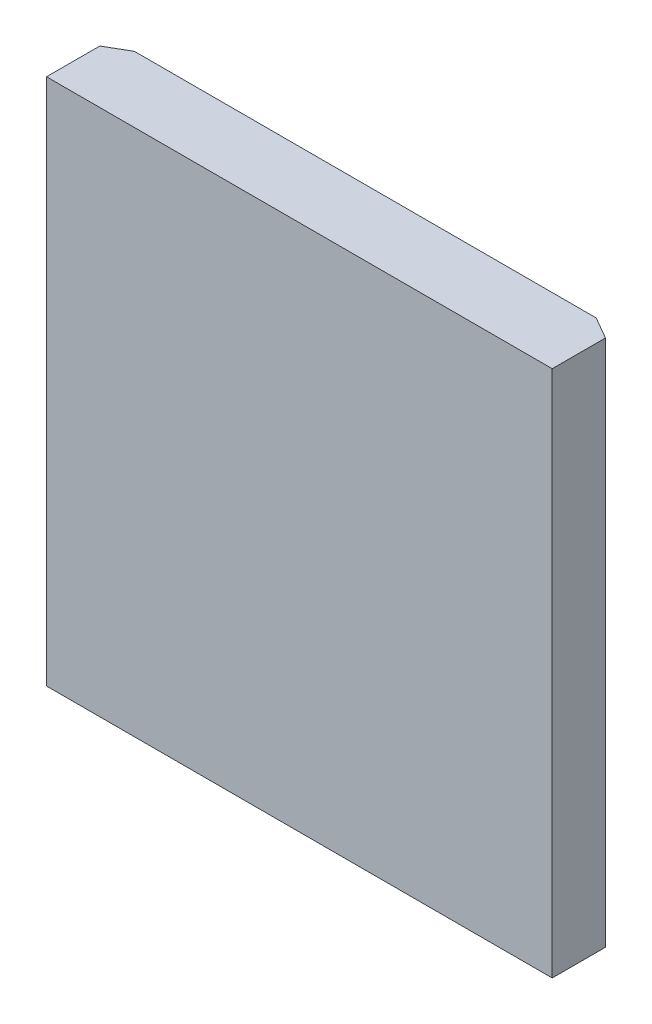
from build123d import *

# Parameters (mm, degrees)
SKETCH1_W           = 292.1
SKETCH1_H           = 38.1
BOSS_EXTRUDE1_DEPTH = 152.4
CHAMFER1_SIZE       = 12.7
CHAMFER1_SIZE2      = 7.332348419
CHAMFER2_SIZE       = 12.7
CHAMFER2_SIZE2      = 7.332348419


with BuildPart() as part:
    # Sketch1 → Boss-Extrude1 (new, symmetric)
    with BuildSketch(Plane(origin=(0, 0, 0), x_dir=(1, 0, 0), z_dir=(0, 1, 0))):
        Rectangle(SKETCH1_W, SKETCH1_H)
    extrude(amount=BOSS_EXTRUDE1_DEPTH, both=True)

    # Chamfer1
    chamfer1_edges = [part.edges().sort_by_distance(p)[0] for p in [
        (-146.05, 0, -19.05),
    ]]
    chamfer1_side = [part.faces().sort_by_distance(p)[0] for p in [
        (0, 0, -19.05),
    ]]
    chamfer(chamfer1_edges, length=CHAMFER1_SIZE, length2=CHAMFER1_SIZE2, reference=chamfer1_side[0])

    # Chamfer2
    chamfer2_edges = [part.edges().sort_by_distance(p)[0] for p in [
        (146.05, 0, -19.05),
    ]]
    chamfer2_side = [part.faces().sort_by_distance(p)[0] for p in [
        (6.35, 0, -19.05),
    ]]
    chamfer(chamfer2_edges, length=CHAMFER2_SIZE, length2=CHAMFER2_SIZE2, reference=chamfer2_side[0])


solid = part.part
